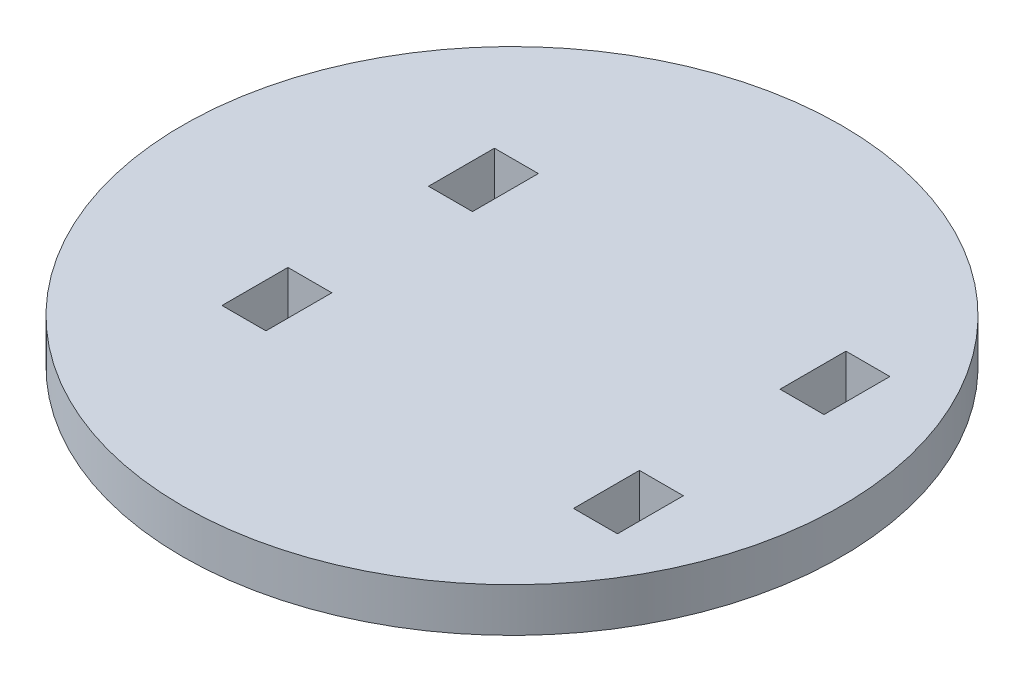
ISO-10303-21;
HEADER;
FILE_DESCRIPTION(('STEP AP214'),'2;1');
FILE_NAME('part.step','',(''),(''),'','','');
FILE_SCHEMA(('AUTOMOTIVE_DESIGN { 1 0 10303 214 1 1 1 1 }'));
ENDSEC;
DATA;
#1=APPLICATION_CONTEXT('core data for automotive mechanical design processes');
#2=APPLICATION_PROTOCOL_DEFINITION('international standard','automotive_design',2000,#1);
#3=PRODUCT_CONTEXT('',#1,'mechanical');
#4=PRODUCT('Part','Part','',(#3));
#5=PRODUCT_RELATED_PRODUCT_CATEGORY('part','',(#4));
#6=PRODUCT_DEFINITION_FORMATION('','',#4);
#7=PRODUCT_DEFINITION_CONTEXT('part definition',#1,'design');
#8=PRODUCT_DEFINITION('design','',#6,#7);
#9=PRODUCT_DEFINITION_SHAPE('','',#8);
#10=(LENGTH_UNIT() NAMED_UNIT(*) SI_UNIT(.MILLI.,.METRE.));
#11=(NAMED_UNIT(*) PLANE_ANGLE_UNIT() SI_UNIT($,.RADIAN.));
#12=(NAMED_UNIT(*) SI_UNIT($,.STERADIAN.) SOLID_ANGLE_UNIT());
#13=UNCERTAINTY_MEASURE_WITH_UNIT(LENGTH_MEASURE(1.E-05),#10,'distance_accuracy_value','');
#14=(GEOMETRIC_REPRESENTATION_CONTEXT(3) GLOBAL_UNCERTAINTY_ASSIGNED_CONTEXT((#13)) GLOBAL_UNIT_ASSIGNED_CONTEXT((#10,
#11,#12)) REPRESENTATION_CONTEXT('',''));
#15=CARTESIAN_POINT('',(0.,0.,0.));
#16=DIRECTION('',(0.,0.,1.));
#17=DIRECTION('',(1.,0.,0.));
#18=AXIS2_PLACEMENT_3D('',#15,#16,#17);
#19=CARTESIAN_POINT('',(0.,5.,0.));
#20=DIRECTION('',(0.,-1.,0.));
#21=DIRECTION('',(0.,0.,-1.));
#22=AXIS2_PLACEMENT_3D('',#19,#20,#21);
#23=CYLINDRICAL_SURFACE('',#22,37.5);
#24=CARTESIAN_POINT('',(0.,5.,0.));
#25=DIRECTION('',(0.,1.,0.));
#26=DIRECTION('',(0.,0.,1.));
#27=AXIS2_PLACEMENT_3D('',#24,#25,#26);
#28=CIRCLE('',#27,37.5);
#29=CARTESIAN_POINT('',(0.,5.,37.5));
#30=VERTEX_POINT('',#29);
#31=EDGE_CURVE('E252',#30,#30,#28,.T.);
#32=ORIENTED_EDGE('',*,*,#31,.F.);
#33=EDGE_LOOP('',(#32));
#34=FACE_BOUND('',#33,.T.);
#35=CARTESIAN_POINT('',(0.,0.,0.));
#36=DIRECTION('',(0.,1.,0.));
#37=DIRECTION('',(0.,0.,1.));
#38=AXIS2_PLACEMENT_3D('',#35,#36,#37);
#39=CIRCLE('',#38,37.5);
#40=CARTESIAN_POINT('',(0.,0.,37.5));
#41=VERTEX_POINT('',#40);
#42=EDGE_CURVE('E237',#41,#41,#39,.T.);
#43=ORIENTED_EDGE('',*,*,#42,.T.);
#44=EDGE_LOOP('',(#43));
#45=FACE_BOUND('',#44,.T.);
#46=ADVANCED_FACE('F32',(#34,#45),#23,.T.);
#47=CARTESIAN_POINT('',(0.,5.,0.));
#48=DIRECTION('',(0.,1.,0.));
#49=DIRECTION('',(0.,0.,1.));
#50=AXIS2_PLACEMENT_3D('',#47,#48,#49);
#51=PLANE('',#50);
#52=DIRECTION('',(0.,0.,-1.));
#53=VECTOR('',#52,1.);
#54=CARTESIAN_POINT('',(-12.5,5.,15.5));
#55=LINE('',#54,#53);
#56=CARTESIAN_POINT('',(-12.5,5.,15.5));
#57=VERTEX_POINT('',#56);
#58=CARTESIAN_POINT('',(-12.5,5.,8.));
#59=VERTEX_POINT('',#58);
#60=EDGE_CURVE('E46',#57,#59,#55,.T.);
#61=ORIENTED_EDGE('',*,*,#60,.F.);
#62=DIRECTION('',(1.,0.,0.));
#63=VECTOR('',#62,1.);
#64=CARTESIAN_POINT('',(-17.5,5.,15.5));
#65=LINE('',#64,#63);
#66=CARTESIAN_POINT('',(-17.5,5.,15.5));
#67=VERTEX_POINT('',#66);
#68=EDGE_CURVE('E182',#67,#57,#65,.T.);
#69=ORIENTED_EDGE('',*,*,#68,.F.);
#70=DIRECTION('',(0.,0.,1.));
#71=VECTOR('',#70,1.);
#72=CARTESIAN_POINT('',(-17.5,5.,8.));
#73=LINE('',#72,#71);
#74=CARTESIAN_POINT('',(-17.5,5.,8.));
#75=VERTEX_POINT('',#74);
#76=EDGE_CURVE('E191',#75,#67,#73,.T.);
#77=ORIENTED_EDGE('',*,*,#76,.F.);
#78=DIRECTION('',(-1.,0.,0.));
#79=VECTOR('',#78,1.);
#80=CARTESIAN_POINT('',(-12.5,5.,8.));
#81=LINE('',#80,#79);
#82=EDGE_CURVE('E194',#59,#75,#81,.T.);
#83=ORIENTED_EDGE('',*,*,#82,.F.);
#84=EDGE_LOOP('',(#61,#69,#77,#83));
#85=FACE_BOUND('',#84,.T.);
#86=DIRECTION('',(0.,0.,-1.));
#87=VECTOR('',#86,1.);
#88=CARTESIAN_POINT('',(27.5,5.,-8.));
#89=LINE('',#88,#87);
#90=CARTESIAN_POINT('',(27.5,5.,-8.));
#91=VERTEX_POINT('',#90);
#92=CARTESIAN_POINT('',(27.5,5.,-15.5));
#93=VERTEX_POINT('',#92);
#94=EDGE_CURVE('E54',#91,#93,#89,.T.);
#95=ORIENTED_EDGE('',*,*,#94,.F.);
#96=DIRECTION('',(1.,0.,0.));
#97=VECTOR('',#96,1.);
#98=CARTESIAN_POINT('',(22.5,5.,-8.));
#99=LINE('',#98,#97);
#100=CARTESIAN_POINT('',(22.5,5.,-8.));
#101=VERTEX_POINT('',#100);
#102=EDGE_CURVE('E201',#101,#91,#99,.T.);
#103=ORIENTED_EDGE('',*,*,#102,.F.);
#104=DIRECTION('',(0.,0.,1.));
#105=VECTOR('',#104,1.);
#106=CARTESIAN_POINT('',(22.5,5.,-15.5));
#107=LINE('',#106,#105);
#108=CARTESIAN_POINT('',(22.5,5.,-15.5));
#109=VERTEX_POINT('',#108);
#110=EDGE_CURVE('E207',#109,#101,#107,.T.);
#111=ORIENTED_EDGE('',*,*,#110,.F.);
#112=DIRECTION('',(-1.,0.,0.));
#113=VECTOR('',#112,1.);
#114=CARTESIAN_POINT('',(27.5,5.,-15.5));
#115=LINE('',#114,#113);
#116=EDGE_CURVE('E210',#93,#109,#115,.T.);
#117=ORIENTED_EDGE('',*,*,#116,.F.);
#118=EDGE_LOOP('',(#95,#103,#111,#117));
#119=FACE_BOUND('',#118,.T.);
#120=DIRECTION('',(0.,0.,-1.));
#121=VECTOR('',#120,1.);
#122=CARTESIAN_POINT('',(27.5,5.,15.5));
#123=LINE('',#122,#121);
#124=CARTESIAN_POINT('',(27.5,5.,15.5));
#125=VERTEX_POINT('',#124);
#126=CARTESIAN_POINT('',(27.5,5.,8.));
#127=VERTEX_POINT('',#126);
#128=EDGE_CURVE('E150',#125,#127,#123,.T.);
#129=ORIENTED_EDGE('',*,*,#128,.F.);
#130=DIRECTION('',(1.,0.,0.));
#131=VECTOR('',#130,1.);
#132=CARTESIAN_POINT('',(22.5,5.,15.5));
#133=LINE('',#132,#131);
#134=CARTESIAN_POINT('',(22.5,5.,15.5));
#135=VERTEX_POINT('',#134);
#136=EDGE_CURVE('E159',#135,#125,#133,.T.);
#137=ORIENTED_EDGE('',*,*,#136,.F.);
#138=DIRECTION('',(0.,0.,1.));
#139=VECTOR('',#138,1.);
#140=CARTESIAN_POINT('',(22.5,5.,8.));
#141=LINE('',#140,#139);
#142=CARTESIAN_POINT('',(22.5,5.,8.));
#143=VERTEX_POINT('',#142);
#144=EDGE_CURVE('E165',#143,#135,#141,.T.);
#145=ORIENTED_EDGE('',*,*,#144,.F.);
#146=DIRECTION('',(-1.,0.,0.));
#147=VECTOR('',#146,1.);
#148=CARTESIAN_POINT('',(27.5,5.,8.));
#149=LINE('',#148,#147);
#150=EDGE_CURVE('E172',#127,#143,#149,.T.);
#151=ORIENTED_EDGE('',*,*,#150,.F.);
#152=EDGE_LOOP('',(#129,#137,#145,#151));
#153=FACE_BOUND('',#152,.T.);
#154=DIRECTION('',(0.,0.,1.));
#155=VECTOR('',#154,1.);
#156=CARTESIAN_POINT('',(-17.5,5.,-15.5));
#157=LINE('',#156,#155);
#158=CARTESIAN_POINT('',(-17.5,5.,-15.5));
#159=VERTEX_POINT('',#158);
#160=CARTESIAN_POINT('',(-17.5,5.,-8.));
#161=VERTEX_POINT('',#160);
#162=EDGE_CURVE('E198',#159,#161,#157,.T.);
#163=ORIENTED_EDGE('',*,*,#162,.F.);
#164=DIRECTION('',(1.,0.,0.));
#165=VECTOR('',#164,1.);
#166=CARTESIAN_POINT('',(-17.5,5.,-15.5));
#167=LINE('',#166,#165);
#168=CARTESIAN_POINT('',(-12.5,5.,-15.5));
#169=VERTEX_POINT('',#168);
#170=EDGE_CURVE('E221',#159,#169,#167,.T.);
#171=ORIENTED_EDGE('',*,*,#170,.T.);
#172=DIRECTION('',(0.,0.,-1.));
#173=VECTOR('',#172,1.);
#174=CARTESIAN_POINT('',(-12.5,5.,-8.));
#175=LINE('',#174,#173);
#176=CARTESIAN_POINT('',(-12.5,5.,-8.));
#177=VERTEX_POINT('',#176);
#178=EDGE_CURVE('E218',#177,#169,#175,.T.);
#179=ORIENTED_EDGE('',*,*,#178,.F.);
#180=DIRECTION('',(1.,0.,0.));
#181=VECTOR('',#180,1.);
#182=CARTESIAN_POINT('',(-17.5,5.,-8.));
#183=LINE('',#182,#181);
#184=EDGE_CURVE('E215',#161,#177,#183,.T.);
#185=ORIENTED_EDGE('',*,*,#184,.F.);
#186=EDGE_LOOP('',(#163,#171,#179,#185));
#187=FACE_BOUND('',#186,.T.);
#188=ORIENTED_EDGE('',*,*,#31,.T.);
#189=EDGE_LOOP('',(#188));
#190=FACE_BOUND('',#189,.T.);
#191=ADVANCED_FACE('F169',(#85,#119,#153,#187,#190),#51,.T.);
#192=CARTESIAN_POINT('',(0.,0.,0.));
#193=DIRECTION('',(0.,1.,0.));
#194=DIRECTION('',(0.,0.,1.));
#195=AXIS2_PLACEMENT_3D('',#192,#193,#194);
#196=PLANE('',#195);
#197=DIRECTION('',(1.,0.,0.));
#198=VECTOR('',#197,1.);
#199=CARTESIAN_POINT('',(0.,0.,15.5));
#200=LINE('',#199,#198);
#201=CARTESIAN_POINT('',(-17.5,0.,15.5));
#202=VERTEX_POINT('',#201);
#203=CARTESIAN_POINT('',(-12.5,0.,15.5));
#204=VERTEX_POINT('',#203);
#205=EDGE_CURVE('E39',#202,#204,#200,.T.);
#206=ORIENTED_EDGE('',*,*,#205,.T.);
#207=DIRECTION('',(0.,0.,-1.));
#208=VECTOR('',#207,1.);
#209=CARTESIAN_POINT('',(-12.5,0.,0.));
#210=LINE('',#209,#208);
#211=CARTESIAN_POINT('',(-12.5,0.,8.));
#212=VERTEX_POINT('',#211);
#213=EDGE_CURVE('E11',#204,#212,#210,.T.);
#214=ORIENTED_EDGE('',*,*,#213,.T.);
#215=DIRECTION('',(-1.,0.,0.));
#216=VECTOR('',#215,1.);
#217=CARTESIAN_POINT('',(0.,0.,8.));
#218=LINE('',#217,#216);
#219=CARTESIAN_POINT('',(-17.5,0.,8.));
#220=VERTEX_POINT('',#219);
#221=EDGE_CURVE('E289',#212,#220,#218,.T.);
#222=ORIENTED_EDGE('',*,*,#221,.T.);
#223=DIRECTION('',(0.,0.,1.));
#224=VECTOR('',#223,1.);
#225=CARTESIAN_POINT('',(-17.5,0.,0.));
#226=LINE('',#225,#224);
#227=EDGE_CURVE('E292',#220,#202,#226,.T.);
#228=ORIENTED_EDGE('',*,*,#227,.T.);
#229=EDGE_LOOP('',(#206,#214,#222,#228));
#230=FACE_BOUND('',#229,.T.);
#231=DIRECTION('',(1.,0.,0.));
#232=VECTOR('',#231,1.);
#233=CARTESIAN_POINT('',(0.,0.,-8.));
#234=LINE('',#233,#232);
#235=CARTESIAN_POINT('',(22.5,0.,-8.));
#236=VERTEX_POINT('',#235);
#237=CARTESIAN_POINT('',(27.5,0.,-8.));
#238=VERTEX_POINT('',#237);
#239=EDGE_CURVE('E283',#236,#238,#234,.T.);
#240=ORIENTED_EDGE('',*,*,#239,.T.);
#241=DIRECTION('',(0.,0.,-1.));
#242=VECTOR('',#241,1.);
#243=CARTESIAN_POINT('',(27.5,0.,0.));
#244=LINE('',#243,#242);
#245=CARTESIAN_POINT('',(27.5,0.,-15.5));
#246=VERTEX_POINT('',#245);
#247=EDGE_CURVE('E286',#238,#246,#244,.T.);
#248=ORIENTED_EDGE('',*,*,#247,.T.);
#249=DIRECTION('',(-1.,0.,0.));
#250=VECTOR('',#249,1.);
#251=CARTESIAN_POINT('',(0.,0.,-15.5));
#252=LINE('',#251,#250);
#253=CARTESIAN_POINT('',(22.5,0.,-15.5));
#254=VERTEX_POINT('',#253);
#255=EDGE_CURVE('E277',#246,#254,#252,.T.);
#256=ORIENTED_EDGE('',*,*,#255,.T.);
#257=DIRECTION('',(0.,0.,1.));
#258=VECTOR('',#257,1.);
#259=CARTESIAN_POINT('',(22.5,0.,0.));
#260=LINE('',#259,#258);
#261=EDGE_CURVE('E280',#254,#236,#260,.T.);
#262=ORIENTED_EDGE('',*,*,#261,.T.);
#263=EDGE_LOOP('',(#240,#248,#256,#262));
#264=FACE_BOUND('',#263,.T.);
#265=DIRECTION('',(1.,0.,0.));
#266=VECTOR('',#265,1.);
#267=CARTESIAN_POINT('',(0.,0.,15.5));
#268=LINE('',#267,#266);
#269=CARTESIAN_POINT('',(22.5,0.,15.5));
#270=VERTEX_POINT('',#269);
#271=CARTESIAN_POINT('',(27.5,0.,15.5));
#272=VERTEX_POINT('',#271);
#273=EDGE_CURVE('E274',#270,#272,#268,.T.);
#274=ORIENTED_EDGE('',*,*,#273,.T.);
#275=DIRECTION('',(0.,0.,-1.));
#276=VECTOR('',#275,1.);
#277=CARTESIAN_POINT('',(27.5,0.,0.));
#278=LINE('',#277,#276);
#279=CARTESIAN_POINT('',(27.5,0.,8.));
#280=VERTEX_POINT('',#279);
#281=EDGE_CURVE('E153',#272,#280,#278,.T.);
#282=ORIENTED_EDGE('',*,*,#281,.T.);
#283=DIRECTION('',(-1.,0.,0.));
#284=VECTOR('',#283,1.);
#285=CARTESIAN_POINT('',(0.,0.,8.));
#286=LINE('',#285,#284);
#287=CARTESIAN_POINT('',(22.5,0.,8.));
#288=VERTEX_POINT('',#287);
#289=EDGE_CURVE('E268',#280,#288,#286,.T.);
#290=ORIENTED_EDGE('',*,*,#289,.T.);
#291=DIRECTION('',(0.,0.,1.));
#292=VECTOR('',#291,1.);
#293=CARTESIAN_POINT('',(22.5,0.,0.));
#294=LINE('',#293,#292);
#295=EDGE_CURVE('E271',#288,#270,#294,.T.);
#296=ORIENTED_EDGE('',*,*,#295,.T.);
#297=EDGE_LOOP('',(#274,#282,#290,#296));
#298=FACE_BOUND('',#297,.T.);
#299=DIRECTION('',(1.,0.,0.));
#300=VECTOR('',#299,1.);
#301=CARTESIAN_POINT('',(0.,0.,-15.5));
#302=LINE('',#301,#300);
#303=CARTESIAN_POINT('',(-17.5,0.,-15.5));
#304=VERTEX_POINT('',#303);
#305=CARTESIAN_POINT('',(-12.5,0.,-15.5));
#306=VERTEX_POINT('',#305);
#307=EDGE_CURVE('E263',#304,#306,#302,.T.);
#308=ORIENTED_EDGE('',*,*,#307,.F.);
#309=DIRECTION('',(0.,0.,1.));
#310=VECTOR('',#309,1.);
#311=CARTESIAN_POINT('',(-17.5,0.,0.));
#312=LINE('',#311,#310);
#313=CARTESIAN_POINT('',(-17.5,0.,-8.));
#314=VERTEX_POINT('',#313);
#315=EDGE_CURVE('E265',#304,#314,#312,.T.);
#316=ORIENTED_EDGE('',*,*,#315,.T.);
#317=DIRECTION('',(1.,0.,0.));
#318=VECTOR('',#317,1.);
#319=CARTESIAN_POINT('',(0.,0.,-8.));
#320=LINE('',#319,#318);
#321=CARTESIAN_POINT('',(-12.5,0.,-8.));
#322=VERTEX_POINT('',#321);
#323=EDGE_CURVE('E255',#314,#322,#320,.T.);
#324=ORIENTED_EDGE('',*,*,#323,.T.);
#325=DIRECTION('',(0.,0.,-1.));
#326=VECTOR('',#325,1.);
#327=CARTESIAN_POINT('',(-12.5,0.,0.));
#328=LINE('',#327,#326);
#329=EDGE_CURVE('E260',#322,#306,#328,.T.);
#330=ORIENTED_EDGE('',*,*,#329,.T.);
#331=EDGE_LOOP('',(#308,#316,#324,#330));
#332=FACE_BOUND('',#331,.T.);
#333=CARTESIAN_POINT('',(0.,0.,15.));
#334=DIRECTION('',(0.,-1.,0.));
#335=DIRECTION('',(0.,0.,-1.));
#336=AXIS2_PLACEMENT_3D('',#333,#334,#335);
#337=CIRCLE('',#336,0.5);
#338=CARTESIAN_POINT('',(0.,0.,14.5));
#339=VERTEX_POINT('',#338);
#340=EDGE_CURVE('E238',#339,#339,#337,.T.);
#341=ORIENTED_EDGE('',*,*,#340,.F.);
#342=EDGE_LOOP('',(#341));
#343=FACE_BOUND('',#342,.T.);
#344=CARTESIAN_POINT('',(0.,0.,11.));
#345=DIRECTION('',(0.,-1.,0.));
#346=DIRECTION('',(0.,0.,-1.));
#347=AXIS2_PLACEMENT_3D('',#344,#345,#346);
#348=CIRCLE('',#347,0.5);
#349=CARTESIAN_POINT('',(0.,0.,10.5));
#350=VERTEX_POINT('',#349);
#351=EDGE_CURVE('E241',#350,#350,#348,.T.);
#352=ORIENTED_EDGE('',*,*,#351,.F.);
#353=EDGE_LOOP('',(#352));
#354=FACE_BOUND('',#353,.T.);
#355=CARTESIAN_POINT('',(0.,0.,0.));
#356=DIRECTION('',(0.,-1.,0.));
#357=DIRECTION('',(0.,0.,-1.));
#358=AXIS2_PLACEMENT_3D('',#355,#356,#357);
#359=CIRCLE('',#358,0.5);
#360=CARTESIAN_POINT('',(0.,0.,-0.5));
#361=VERTEX_POINT('',#360);
#362=EDGE_CURVE('E247',#361,#361,#359,.T.);
#363=ORIENTED_EDGE('',*,*,#362,.F.);
#364=EDGE_LOOP('',(#363));
#365=FACE_BOUND('',#364,.T.);
#366=ORIENTED_EDGE('',*,*,#42,.F.);
#367=EDGE_LOOP('',(#366));
#368=FACE_BOUND('',#367,.T.);
#369=ADVANCED_FACE('F296',(#230,#264,#298,#332,#343,#354,#365,#368),#196,.F.);
#370=CARTESIAN_POINT('',(0.,1.,0.));
#371=DIRECTION('',(0.,-1.,0.));
#372=DIRECTION('',(0.,0.,-1.));
#373=AXIS2_PLACEMENT_3D('',#370,#371,#372);
#374=CYLINDRICAL_SURFACE('',#373,0.5);
#375=CARTESIAN_POINT('',(0.,1.,0.));
#376=DIRECTION('',(0.,-1.,0.));
#377=DIRECTION('',(0.,0.,-1.));
#378=AXIS2_PLACEMENT_3D('',#375,#376,#377);
#379=CIRCLE('',#378,0.5);
#380=CARTESIAN_POINT('',(0.,1.,-0.5));
#381=VERTEX_POINT('',#380);
#382=EDGE_CURVE('E227',#381,#381,#379,.T.);
#383=ORIENTED_EDGE('',*,*,#382,.F.);
#384=EDGE_LOOP('',(#383));
#385=FACE_BOUND('',#384,.T.);
#386=ORIENTED_EDGE('',*,*,#362,.T.);
#387=EDGE_LOOP('',(#386));
#388=FACE_BOUND('',#387,.T.);
#389=ADVANCED_FACE('F337',(#385,#388),#374,.F.);
#390=CARTESIAN_POINT('',(0.,1.,0.));
#391=DIRECTION('',(0.,-1.,0.));
#392=DIRECTION('',(0.,0.,-1.));
#393=AXIS2_PLACEMENT_3D('',#390,#391,#392);
#394=PLANE('',#393);
#395=ORIENTED_EDGE('',*,*,#382,.T.);
#396=EDGE_LOOP('',(#395));
#397=FACE_BOUND('',#396,.T.);
#398=ADVANCED_FACE('F341',(#397),#394,.T.);
#399=CARTESIAN_POINT('',(0.,1.,11.));
#400=DIRECTION('',(0.,-1.,0.));
#401=DIRECTION('',(0.,0.,-1.));
#402=AXIS2_PLACEMENT_3D('',#399,#400,#401);
#403=CYLINDRICAL_SURFACE('',#402,0.5);
#404=CARTESIAN_POINT('',(0.,1.,11.));
#405=DIRECTION('',(0.,-1.,0.));
#406=DIRECTION('',(0.,0.,-1.));
#407=AXIS2_PLACEMENT_3D('',#404,#405,#406);
#408=CIRCLE('',#407,0.5);
#409=CARTESIAN_POINT('',(0.,1.,10.5));
#410=VERTEX_POINT('',#409);
#411=EDGE_CURVE('E244',#410,#410,#408,.T.);
#412=ORIENTED_EDGE('',*,*,#411,.F.);
#413=EDGE_LOOP('',(#412));
#414=FACE_BOUND('',#413,.T.);
#415=ORIENTED_EDGE('',*,*,#351,.T.);
#416=EDGE_LOOP('',(#415));
#417=FACE_BOUND('',#416,.T.);
#418=ADVANCED_FACE('F346',(#414,#417),#403,.F.);
#419=CARTESIAN_POINT('',(0.,1.,11.));
#420=DIRECTION('',(0.,-1.,0.));
#421=DIRECTION('',(0.,0.,-1.));
#422=AXIS2_PLACEMENT_3D('',#419,#420,#421);
#423=PLANE('',#422);
#424=ORIENTED_EDGE('',*,*,#411,.T.);
#425=EDGE_LOOP('',(#424));
#426=FACE_BOUND('',#425,.T.);
#427=ADVANCED_FACE('F349',(#426),#423,.T.);
#428=CARTESIAN_POINT('',(0.,1.,15.));
#429=DIRECTION('',(0.,-1.,0.));
#430=DIRECTION('',(0.,0.,-1.));
#431=AXIS2_PLACEMENT_3D('',#428,#429,#430);
#432=CYLINDRICAL_SURFACE('',#431,0.5);
#433=CARTESIAN_POINT('',(0.,1.,15.));
#434=DIRECTION('',(0.,-1.,0.));
#435=DIRECTION('',(0.,0.,-1.));
#436=AXIS2_PLACEMENT_3D('',#433,#434,#435);
#437=CIRCLE('',#436,0.5);
#438=CARTESIAN_POINT('',(0.,1.,14.5));
#439=VERTEX_POINT('',#438);
#440=EDGE_CURVE('E234',#439,#439,#437,.T.);
#441=ORIENTED_EDGE('',*,*,#440,.F.);
#442=EDGE_LOOP('',(#441));
#443=FACE_BOUND('',#442,.T.);
#444=ORIENTED_EDGE('',*,*,#340,.T.);
#445=EDGE_LOOP('',(#444));
#446=FACE_BOUND('',#445,.T.);
#447=ADVANCED_FACE('F352',(#443,#446),#432,.F.);
#448=CARTESIAN_POINT('',(0.,1.,15.));
#449=DIRECTION('',(0.,-1.,0.));
#450=DIRECTION('',(0.,0.,-1.));
#451=AXIS2_PLACEMENT_3D('',#448,#449,#450);
#452=PLANE('',#451);
#453=ORIENTED_EDGE('',*,*,#440,.T.);
#454=EDGE_LOOP('',(#453));
#455=FACE_BOUND('',#454,.T.);
#456=ADVANCED_FACE('F359',(#455),#452,.T.);
#457=CARTESIAN_POINT('',(-17.5,-5.,-15.5));
#458=DIRECTION('',(-1.,0.,0.));
#459=DIRECTION('',(0.,0.,1.));
#460=AXIS2_PLACEMENT_3D('',#457,#458,#459);
#461=PLANE('',#460);
#462=DIRECTION('',(0.,1.,0.));
#463=VECTOR('',#462,1.);
#464=CARTESIAN_POINT('',(-17.5,-5.,-15.5));
#465=LINE('',#464,#463);
#466=EDGE_CURVE('E225',#304,#159,#465,.T.);
#467=ORIENTED_EDGE('',*,*,#466,.T.);
#468=ORIENTED_EDGE('',*,*,#162,.T.);
#469=DIRECTION('',(0.,1.,0.));
#470=VECTOR('',#469,1.);
#471=CARTESIAN_POINT('',(-17.5,-5.,-8.));
#472=LINE('',#471,#470);
#473=EDGE_CURVE('E224',#314,#161,#472,.T.);
#474=ORIENTED_EDGE('',*,*,#473,.F.);
#475=ORIENTED_EDGE('',*,*,#315,.F.);
#476=EDGE_LOOP('',(#467,#468,#474,#475));
#477=FACE_BOUND('',#476,.T.);
#478=ADVANCED_FACE('F363',(#477),#461,.F.);
#479=CARTESIAN_POINT('',(-17.5,-5.,-15.5));
#480=DIRECTION('',(0.,0.,1.));
#481=DIRECTION('',(1.,0.,0.));
#482=AXIS2_PLACEMENT_3D('',#479,#480,#481);
#483=PLANE('',#482);
#484=ORIENTED_EDGE('',*,*,#307,.T.);
#485=DIRECTION('',(0.,1.,0.));
#486=VECTOR('',#485,1.);
#487=CARTESIAN_POINT('',(-12.5,-5.,-15.5));
#488=LINE('',#487,#486);
#489=EDGE_CURVE('E228',#306,#169,#488,.T.);
#490=ORIENTED_EDGE('',*,*,#489,.T.);
#491=ORIENTED_EDGE('',*,*,#170,.F.);
#492=ORIENTED_EDGE('',*,*,#466,.F.);
#493=EDGE_LOOP('',(#484,#490,#491,#492));
#494=FACE_BOUND('',#493,.T.);
#495=ADVANCED_FACE('F367',(#494),#483,.T.);
#496=CARTESIAN_POINT('',(-12.5,-5.,-8.));
#497=DIRECTION('',(1.,0.,0.));
#498=DIRECTION('',(0.,0.,-1.));
#499=AXIS2_PLACEMENT_3D('',#496,#497,#498);
#500=PLANE('',#499);
#501=DIRECTION('',(0.,1.,0.));
#502=VECTOR('',#501,1.);
#503=CARTESIAN_POINT('',(-12.5,-5.,-8.));
#504=LINE('',#503,#502);
#505=EDGE_CURVE('E230',#322,#177,#504,.T.);
#506=ORIENTED_EDGE('',*,*,#505,.T.);
#507=ORIENTED_EDGE('',*,*,#178,.T.);
#508=ORIENTED_EDGE('',*,*,#489,.F.);
#509=ORIENTED_EDGE('',*,*,#329,.F.);
#510=EDGE_LOOP('',(#506,#507,#508,#509));
#511=FACE_BOUND('',#510,.T.);
#512=ADVANCED_FACE('F372',(#511),#500,.F.);
#513=CARTESIAN_POINT('',(-17.5,-5.,-8.));
#514=DIRECTION('',(0.,0.,1.));
#515=DIRECTION('',(1.,0.,0.));
#516=AXIS2_PLACEMENT_3D('',#513,#514,#515);
#517=PLANE('',#516);
#518=ORIENTED_EDGE('',*,*,#473,.T.);
#519=ORIENTED_EDGE('',*,*,#184,.T.);
#520=ORIENTED_EDGE('',*,*,#505,.F.);
#521=ORIENTED_EDGE('',*,*,#323,.F.);
#522=EDGE_LOOP('',(#518,#519,#520,#521));
#523=FACE_BOUND('',#522,.T.);
#524=ADVANCED_FACE('F369',(#523),#517,.F.);
#525=CARTESIAN_POINT('',(27.5,-5.,15.5));
#526=DIRECTION('',(1.,0.,0.));
#527=DIRECTION('',(0.,0.,-1.));
#528=AXIS2_PLACEMENT_3D('',#525,#526,#527);
#529=PLANE('',#528);
#530=DIRECTION('',(0.,1.,0.));
#531=VECTOR('',#530,1.);
#532=CARTESIAN_POINT('',(27.5,-5.,15.5));
#533=LINE('',#532,#531);
#534=EDGE_CURVE('E145',#272,#125,#533,.T.);
#535=ORIENTED_EDGE('',*,*,#534,.T.);
#536=ORIENTED_EDGE('',*,*,#128,.T.);
#537=DIRECTION('',(0.,1.,0.));
#538=VECTOR('',#537,1.);
#539=CARTESIAN_POINT('',(27.5,-5.,8.));
#540=LINE('',#539,#538);
#541=EDGE_CURVE('E166',#280,#127,#540,.T.);
#542=ORIENTED_EDGE('',*,*,#541,.F.);
#543=ORIENTED_EDGE('',*,*,#281,.F.);
#544=EDGE_LOOP('',(#535,#536,#542,#543));
#545=FACE_BOUND('',#544,.T.);
#546=ADVANCED_FACE('F147',(#545),#529,.F.);
#547=CARTESIAN_POINT('',(22.5,-5.,15.5));
#548=DIRECTION('',(0.,0.,1.));
#549=DIRECTION('',(1.,0.,0.));
#550=AXIS2_PLACEMENT_3D('',#547,#548,#549);
#551=PLANE('',#550);
#552=DIRECTION('',(0.,1.,0.));
#553=VECTOR('',#552,1.);
#554=CARTESIAN_POINT('',(22.5,-5.,15.5));
#555=LINE('',#554,#553);
#556=EDGE_CURVE('E156',#270,#135,#555,.T.);
#557=ORIENTED_EDGE('',*,*,#556,.T.);
#558=ORIENTED_EDGE('',*,*,#136,.T.);
#559=ORIENTED_EDGE('',*,*,#534,.F.);
#560=ORIENTED_EDGE('',*,*,#273,.F.);
#561=EDGE_LOOP('',(#557,#558,#559,#560));
#562=FACE_BOUND('',#561,.T.);
#563=ADVANCED_FACE('F160',(#562),#551,.F.);
#564=CARTESIAN_POINT('',(22.5,-5.,8.));
#565=DIRECTION('',(-1.,0.,0.));
#566=DIRECTION('',(0.,0.,1.));
#567=AXIS2_PLACEMENT_3D('',#564,#565,#566);
#568=PLANE('',#567);
#569=DIRECTION('',(0.,1.,0.));
#570=VECTOR('',#569,1.);
#571=CARTESIAN_POINT('',(22.5,-5.,8.));
#572=LINE('',#571,#570);
#573=EDGE_CURVE('E544',#288,#143,#572,.T.);
#574=ORIENTED_EDGE('',*,*,#573,.T.);
#575=ORIENTED_EDGE('',*,*,#144,.T.);
#576=ORIENTED_EDGE('',*,*,#556,.F.);
#577=ORIENTED_EDGE('',*,*,#295,.F.);
#578=EDGE_LOOP('',(#574,#575,#576,#577));
#579=FACE_BOUND('',#578,.T.);
#580=ADVANCED_FACE('F440',(#579),#568,.F.);
#581=CARTESIAN_POINT('',(27.5,-5.,8.));
#582=DIRECTION('',(0.,0.,-1.));
#583=DIRECTION('',(-1.,0.,0.));
#584=AXIS2_PLACEMENT_3D('',#581,#582,#583);
#585=PLANE('',#584);
#586=ORIENTED_EDGE('',*,*,#541,.T.);
#587=ORIENTED_EDGE('',*,*,#150,.T.);
#588=ORIENTED_EDGE('',*,*,#573,.F.);
#589=ORIENTED_EDGE('',*,*,#289,.F.);
#590=EDGE_LOOP('',(#586,#587,#588,#589));
#591=FACE_BOUND('',#590,.T.);
#592=ADVANCED_FACE('F389',(#591),#585,.F.);
#593=CARTESIAN_POINT('',(27.5,-5.,-8.));
#594=DIRECTION('',(1.,0.,0.));
#595=DIRECTION('',(0.,0.,-1.));
#596=AXIS2_PLACEMENT_3D('',#593,#594,#595);
#597=PLANE('',#596);
#598=DIRECTION('',(0.,1.,0.));
#599=VECTOR('',#598,1.);
#600=CARTESIAN_POINT('',(27.5,-5.,-8.));
#601=LINE('',#600,#599);
#602=EDGE_CURVE('E173',#238,#91,#601,.T.);
#603=ORIENTED_EDGE('',*,*,#602,.T.);
#604=ORIENTED_EDGE('',*,*,#94,.T.);
#605=DIRECTION('',(0.,1.,0.));
#606=VECTOR('',#605,1.);
#607=CARTESIAN_POINT('',(27.5,-5.,-15.5));
#608=LINE('',#607,#606);
#609=EDGE_CURVE('E199',#246,#93,#608,.T.);
#610=ORIENTED_EDGE('',*,*,#609,.F.);
#611=ORIENTED_EDGE('',*,*,#247,.F.);
#612=EDGE_LOOP('',(#603,#604,#610,#611));
#613=FACE_BOUND('',#612,.T.);
#614=ADVANCED_FACE('F383',(#613),#597,.F.);
#615=CARTESIAN_POINT('',(22.5,-5.,-8.));
#616=DIRECTION('',(0.,0.,1.));
#617=DIRECTION('',(1.,0.,0.));
#618=AXIS2_PLACEMENT_3D('',#615,#616,#617);
#619=PLANE('',#618);
#620=DIRECTION('',(0.,1.,0.));
#621=VECTOR('',#620,1.);
#622=CARTESIAN_POINT('',(22.5,-5.,-8.));
#623=LINE('',#622,#621);
#624=EDGE_CURVE('E175',#236,#101,#623,.T.);
#625=ORIENTED_EDGE('',*,*,#624,.T.);
#626=ORIENTED_EDGE('',*,*,#102,.T.);
#627=ORIENTED_EDGE('',*,*,#602,.F.);
#628=ORIENTED_EDGE('',*,*,#239,.F.);
#629=EDGE_LOOP('',(#625,#626,#627,#628));
#630=FACE_BOUND('',#629,.T.);
#631=ADVANCED_FACE('F380',(#630),#619,.F.);
#632=CARTESIAN_POINT('',(22.5,-5.,-15.5));
#633=DIRECTION('',(-1.,0.,0.));
#634=DIRECTION('',(0.,0.,1.));
#635=AXIS2_PLACEMENT_3D('',#632,#633,#634);
#636=PLANE('',#635);
#637=DIRECTION('',(0.,1.,0.));
#638=VECTOR('',#637,1.);
#639=CARTESIAN_POINT('',(22.5,-5.,-15.5));
#640=LINE('',#639,#638);
#641=EDGE_CURVE('E202',#254,#109,#640,.T.);
#642=ORIENTED_EDGE('',*,*,#641,.T.);
#643=ORIENTED_EDGE('',*,*,#110,.T.);
#644=ORIENTED_EDGE('',*,*,#624,.F.);
#645=ORIENTED_EDGE('',*,*,#261,.F.);
#646=EDGE_LOOP('',(#642,#643,#644,#645));
#647=FACE_BOUND('',#646,.T.);
#648=ADVANCED_FACE('F321',(#647),#636,.F.);
#649=CARTESIAN_POINT('',(27.5,-5.,-15.5));
#650=DIRECTION('',(0.,0.,-1.));
#651=DIRECTION('',(-1.,0.,0.));
#652=AXIS2_PLACEMENT_3D('',#649,#650,#651);
#653=PLANE('',#652);
#654=ORIENTED_EDGE('',*,*,#609,.T.);
#655=ORIENTED_EDGE('',*,*,#116,.T.);
#656=ORIENTED_EDGE('',*,*,#641,.F.);
#657=ORIENTED_EDGE('',*,*,#255,.F.);
#658=EDGE_LOOP('',(#654,#655,#656,#657));
#659=FACE_BOUND('',#658,.T.);
#660=ADVANCED_FACE('F314',(#659),#653,.F.);
#661=CARTESIAN_POINT('',(-12.5,-5.,15.5));
#662=DIRECTION('',(1.,0.,0.));
#663=DIRECTION('',(0.,0.,-1.));
#664=AXIS2_PLACEMENT_3D('',#661,#662,#663);
#665=PLANE('',#664);
#666=DIRECTION('',(0.,1.,0.));
#667=VECTOR('',#666,1.);
#668=CARTESIAN_POINT('',(-12.5,-5.,15.5));
#669=LINE('',#668,#667);
#670=EDGE_CURVE('E187',#204,#57,#669,.T.);
#671=ORIENTED_EDGE('',*,*,#670,.T.);
#672=ORIENTED_EDGE('',*,*,#60,.T.);
#673=DIRECTION('',(0.,1.,0.));
#674=VECTOR('',#673,1.);
#675=CARTESIAN_POINT('',(-12.5,-5.,8.));
#676=LINE('',#675,#674);
#677=EDGE_CURVE('E180',#212,#59,#676,.T.);
#678=ORIENTED_EDGE('',*,*,#677,.F.);
#679=ORIENTED_EDGE('',*,*,#213,.F.);
#680=EDGE_LOOP('',(#671,#672,#678,#679));
#681=FACE_BOUND('',#680,.T.);
#682=ADVANCED_FACE('F312',(#681),#665,.F.);
#683=CARTESIAN_POINT('',(-17.5,-5.,15.5));
#684=DIRECTION('',(0.,0.,1.));
#685=DIRECTION('',(1.,0.,0.));
#686=AXIS2_PLACEMENT_3D('',#683,#684,#685);
#687=PLANE('',#686);
#688=DIRECTION('',(0.,1.,0.));
#689=VECTOR('',#688,1.);
#690=CARTESIAN_POINT('',(-17.5,-5.,15.5));
#691=LINE('',#690,#689);
#692=EDGE_CURVE('E185',#202,#67,#691,.T.);
#693=ORIENTED_EDGE('',*,*,#692,.T.);
#694=ORIENTED_EDGE('',*,*,#68,.T.);
#695=ORIENTED_EDGE('',*,*,#670,.F.);
#696=ORIENTED_EDGE('',*,*,#205,.F.);
#697=EDGE_LOOP('',(#693,#694,#695,#696));
#698=FACE_BOUND('',#697,.T.);
#699=ADVANCED_FACE('F302',(#698),#687,.F.);
#700=CARTESIAN_POINT('',(-17.5,-5.,8.));
#701=DIRECTION('',(-1.,0.,0.));
#702=DIRECTION('',(0.,0.,1.));
#703=AXIS2_PLACEMENT_3D('',#700,#701,#702);
#704=PLANE('',#703);
#705=DIRECTION('',(0.,1.,0.));
#706=VECTOR('',#705,1.);
#707=CARTESIAN_POINT('',(-17.5,-5.,8.));
#708=LINE('',#707,#706);
#709=EDGE_CURVE('E183',#220,#75,#708,.T.);
#710=ORIENTED_EDGE('',*,*,#709,.T.);
#711=ORIENTED_EDGE('',*,*,#76,.T.);
#712=ORIENTED_EDGE('',*,*,#692,.F.);
#713=ORIENTED_EDGE('',*,*,#227,.F.);
#714=EDGE_LOOP('',(#710,#711,#712,#713));
#715=FACE_BOUND('',#714,.T.);
#716=ADVANCED_FACE('F304',(#715),#704,.F.);
#717=CARTESIAN_POINT('',(-12.5,-5.,8.));
#718=DIRECTION('',(0.,0.,-1.));
#719=DIRECTION('',(-1.,0.,0.));
#720=AXIS2_PLACEMENT_3D('',#717,#718,#719);
#721=PLANE('',#720);
#722=ORIENTED_EDGE('',*,*,#677,.T.);
#723=ORIENTED_EDGE('',*,*,#82,.T.);
#724=ORIENTED_EDGE('',*,*,#709,.F.);
#725=ORIENTED_EDGE('',*,*,#221,.F.);
#726=EDGE_LOOP('',(#722,#723,#724,#725));
#727=FACE_BOUND('',#726,.T.);
#728=ADVANCED_FACE('F311',(#727),#721,.F.);
#729=CLOSED_SHELL('',(#46,#191,#369,#389,#398,#418,#427,#447,#456,#478,#495,#512,#524,#546,#563,
#580,#592,#614,#631,#648,#660,#682,#699,#716,#728));
#730=MANIFOLD_SOLID_BREP('B2',#729);
#731=ADVANCED_BREP_SHAPE_REPRESENTATION('',(#18,#730),#14);
#732=SHAPE_DEFINITION_REPRESENTATION(#9,#731);
ENDSEC;
END-ISO-10303-21;
